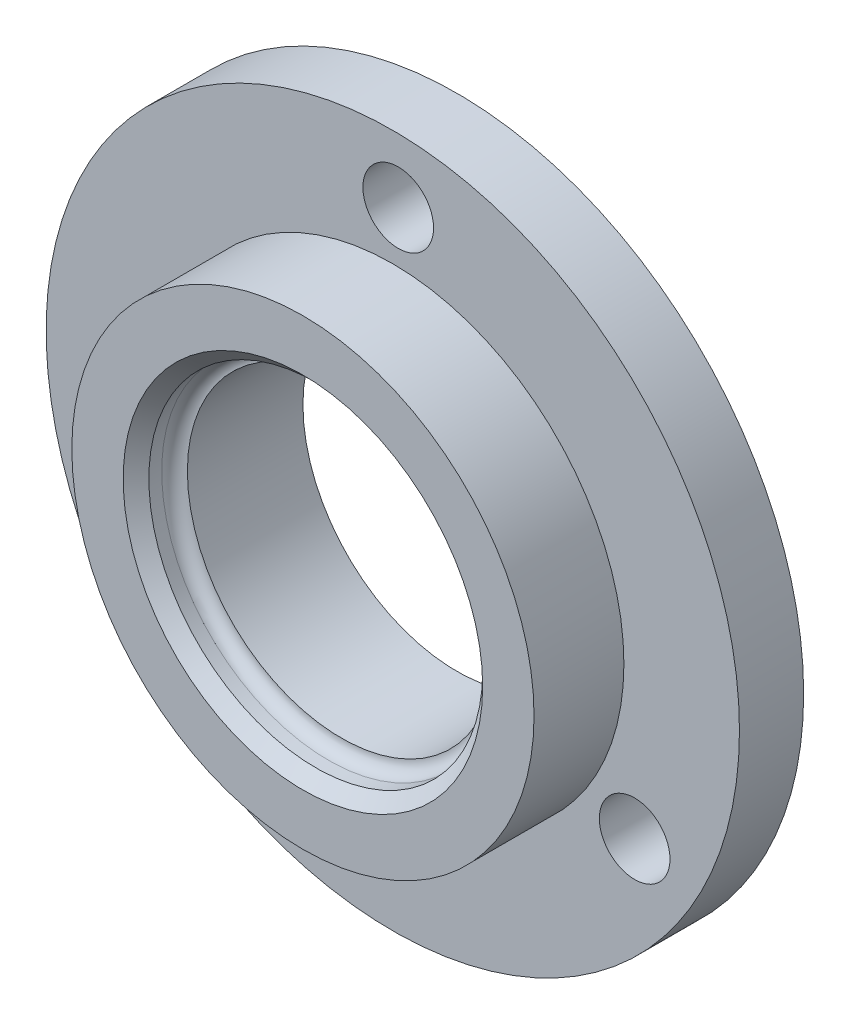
ISO-10303-21;
HEADER;
FILE_DESCRIPTION(('STEP AP214'),'2;1');
FILE_NAME('part.step','',(''),(''),'','','');
FILE_SCHEMA(('AUTOMOTIVE_DESIGN { 1 0 10303 214 1 1 1 1 }'));
ENDSEC;
DATA;
#1=APPLICATION_CONTEXT('core data for automotive mechanical design processes');
#2=APPLICATION_PROTOCOL_DEFINITION('international standard','automotive_design',2000,#1);
#3=PRODUCT_CONTEXT('',#1,'mechanical');
#4=PRODUCT('Part','Part','',(#3));
#5=PRODUCT_RELATED_PRODUCT_CATEGORY('part','',(#4));
#6=PRODUCT_DEFINITION_FORMATION('','',#4);
#7=PRODUCT_DEFINITION_CONTEXT('part definition',#1,'design');
#8=PRODUCT_DEFINITION('design','',#6,#7);
#9=PRODUCT_DEFINITION_SHAPE('','',#8);
#10=(LENGTH_UNIT() NAMED_UNIT(*) SI_UNIT(.MILLI.,.METRE.));
#11=(NAMED_UNIT(*) PLANE_ANGLE_UNIT() SI_UNIT($,.RADIAN.));
#12=(NAMED_UNIT(*) SI_UNIT($,.STERADIAN.) SOLID_ANGLE_UNIT());
#13=UNCERTAINTY_MEASURE_WITH_UNIT(LENGTH_MEASURE(1.E-05),#10,'distance_accuracy_value','');
#14=(GEOMETRIC_REPRESENTATION_CONTEXT(3) GLOBAL_UNCERTAINTY_ASSIGNED_CONTEXT((#13)) GLOBAL_UNIT_ASSIGNED_CONTEXT((#10,
#11,#12)) REPRESENTATION_CONTEXT('',''));
#15=CARTESIAN_POINT('',(0.,0.,0.));
#16=DIRECTION('',(0.,0.,1.));
#17=DIRECTION('',(1.,0.,0.));
#18=AXIS2_PLACEMENT_3D('',#15,#16,#17);
#19=CARTESIAN_POINT('',(0.,0.,0.));
#20=DIRECTION('',(0.,0.,1.));
#21=DIRECTION('',(1.,0.,0.));
#22=AXIS2_PLACEMENT_3D('',#19,#20,#21);
#23=PLANE('',#22);
#24=CARTESIAN_POINT('',(0.,0.,0.));
#25=DIRECTION('',(0.,0.,-1.));
#26=DIRECTION('',(-1.,0.,0.));
#27=AXIS2_PLACEMENT_3D('',#24,#25,#26);
#28=CIRCLE('',#27,12.);
#29=CARTESIAN_POINT('',(-12.,0.,0.));
#30=VERTEX_POINT('',#29);
#31=EDGE_CURVE('E79',#30,#30,#28,.T.);
#32=ORIENTED_EDGE('',*,*,#31,.F.);
#33=EDGE_LOOP('',(#32));
#34=FACE_BOUND('',#33,.T.);
#35=CARTESIAN_POINT('',(-19.260536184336,-10.6316389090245,0.));
#36=DIRECTION('',(0.,0.,-1.));
#37=DIRECTION('',(-1.,0.,0.));
#38=AXIS2_PLACEMENT_3D('',#35,#36,#37);
#39=CIRCLE('',#38,2.75);
#40=CARTESIAN_POINT('',(-22.010536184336,-10.6316389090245,0.));
#41=VERTEX_POINT('',#40);
#42=EDGE_CURVE('E73',#41,#41,#39,.T.);
#43=ORIENTED_EDGE('',*,*,#42,.F.);
#44=EDGE_LOOP('',(#43));
#45=FACE_BOUND('',#44,.T.);
#46=CARTESIAN_POINT('',(18.8375374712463,-11.3642941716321,0.));
#47=DIRECTION('',(0.,0.,-1.));
#48=DIRECTION('',(-1.,0.,0.));
#49=AXIS2_PLACEMENT_3D('',#46,#47,#48);
#50=CIRCLE('',#49,2.75);
#51=CARTESIAN_POINT('',(16.0875374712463,-11.3642941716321,0.));
#52=VERTEX_POINT('',#51);
#53=EDGE_CURVE('E67',#52,#52,#50,.T.);
#54=ORIENTED_EDGE('',*,*,#53,.F.);
#55=EDGE_LOOP('',(#54));
#56=FACE_BOUND('',#55,.T.);
#57=CARTESIAN_POINT('',(0.,0.,0.));
#58=DIRECTION('',(0.,0.,1.));
#59=DIRECTION('',(1.,0.,0.));
#60=AXIS2_PLACEMENT_3D('',#57,#58,#59);
#61=CIRCLE('',#60,27.);
#62=CARTESIAN_POINT('',(27.,0.,0.));
#63=VERTEX_POINT('',#62);
#64=EDGE_CURVE('E49',#63,#63,#61,.T.);
#65=ORIENTED_EDGE('',*,*,#64,.F.);
#66=EDGE_LOOP('',(#65));
#67=FACE_BOUND('',#66,.T.);
#68=CARTESIAN_POINT('',(0.422998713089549,21.9959330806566,0.));
#69=DIRECTION('',(0.,0.,-1.));
#70=DIRECTION('',(-1.,0.,0.));
#71=AXIS2_PLACEMENT_3D('',#68,#69,#70);
#72=CIRCLE('',#71,2.75);
#73=CARTESIAN_POINT('',(-2.32700128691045,21.9959330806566,0.));
#74=VERTEX_POINT('',#73);
#75=EDGE_CURVE('E61',#74,#74,#72,.T.);
#76=ORIENTED_EDGE('',*,*,#75,.F.);
#77=EDGE_LOOP('',(#76));
#78=FACE_BOUND('',#77,.T.);
#79=ADVANCED_FACE('F29',(#34,#45,#56,#67,#78),#23,.F.);
#80=CARTESIAN_POINT('',(0.,0.,5.));
#81=DIRECTION('',(0.,0.,1.));
#82=DIRECTION('',(1.,0.,0.));
#83=AXIS2_PLACEMENT_3D('',#80,#81,#82);
#84=PLANE('',#83);
#85=CARTESIAN_POINT('',(-19.260536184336,-10.6316389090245,5.));
#86=DIRECTION('',(0.,0.,1.));
#87=DIRECTION('',(1.,0.,0.));
#88=AXIS2_PLACEMENT_3D('',#85,#86,#87);
#89=CIRCLE('',#88,2.75);
#90=CARTESIAN_POINT('',(-16.510536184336,-10.6316389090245,5.));
#91=VERTEX_POINT('',#90);
#92=EDGE_CURVE('E70',#91,#91,#89,.T.);
#93=ORIENTED_EDGE('',*,*,#92,.F.);
#94=EDGE_LOOP('',(#93));
#95=FACE_BOUND('',#94,.T.);
#96=CARTESIAN_POINT('',(18.8375374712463,-11.3642941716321,5.));
#97=DIRECTION('',(0.,0.,1.));
#98=DIRECTION('',(1.,0.,0.));
#99=AXIS2_PLACEMENT_3D('',#96,#97,#98);
#100=CIRCLE('',#99,2.75);
#101=CARTESIAN_POINT('',(21.5875374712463,-11.3642941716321,5.));
#102=VERTEX_POINT('',#101);
#103=EDGE_CURVE('E64',#102,#102,#100,.T.);
#104=ORIENTED_EDGE('',*,*,#103,.F.);
#105=EDGE_LOOP('',(#104));
#106=FACE_BOUND('',#105,.T.);
#107=CARTESIAN_POINT('',(0.422998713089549,21.9959330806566,5.));
#108=DIRECTION('',(0.,0.,1.));
#109=DIRECTION('',(1.,0.,0.));
#110=AXIS2_PLACEMENT_3D('',#107,#108,#109);
#111=CIRCLE('',#110,2.75);
#112=CARTESIAN_POINT('',(3.17299871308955,21.9959330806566,5.));
#113=VERTEX_POINT('',#112);
#114=EDGE_CURVE('E58',#113,#113,#111,.T.);
#115=ORIENTED_EDGE('',*,*,#114,.F.);
#116=EDGE_LOOP('',(#115));
#117=FACE_BOUND('',#116,.T.);
#118=CARTESIAN_POINT('',(0.,0.,5.));
#119=DIRECTION('',(0.,0.,1.));
#120=DIRECTION('',(1.,0.,0.));
#121=AXIS2_PLACEMENT_3D('',#118,#119,#120);
#122=CIRCLE('',#121,27.);
#123=CARTESIAN_POINT('',(27.,0.,5.));
#124=VERTEX_POINT('',#123);
#125=EDGE_CURVE('E44',#124,#124,#122,.T.);
#126=ORIENTED_EDGE('',*,*,#125,.T.);
#127=EDGE_LOOP('',(#126));
#128=FACE_BOUND('',#127,.T.);
#129=CARTESIAN_POINT('',(0.,0.,5.));
#130=DIRECTION('',(0.,0.,1.));
#131=DIRECTION('',(1.,0.,0.));
#132=AXIS2_PLACEMENT_3D('',#129,#130,#131);
#133=CIRCLE('',#132,18.);
#134=CARTESIAN_POINT('',(18.,0.,5.));
#135=VERTEX_POINT('',#134);
#136=EDGE_CURVE('E55',#135,#135,#133,.T.);
#137=ORIENTED_EDGE('',*,*,#136,.F.);
#138=EDGE_LOOP('',(#137));
#139=FACE_BOUND('',#138,.T.);
#140=ADVANCED_FACE('F88',(#95,#106,#117,#128,#139),#84,.T.);
#141=CARTESIAN_POINT('',(0.,0.,5.));
#142=DIRECTION('',(0.,0.,-1.));
#143=DIRECTION('',(-1.,0.,0.));
#144=AXIS2_PLACEMENT_3D('',#141,#142,#143);
#145=CYLINDRICAL_SURFACE('',#144,27.);
#146=ORIENTED_EDGE('',*,*,#125,.F.);
#147=EDGE_LOOP('',(#146));
#148=FACE_BOUND('',#147,.T.);
#149=ORIENTED_EDGE('',*,*,#64,.T.);
#150=EDGE_LOOP('',(#149));
#151=FACE_BOUND('',#150,.T.);
#152=ADVANCED_FACE('F31',(#148,#151),#145,.T.);
#153=CARTESIAN_POINT('',(0.,0.,12.));
#154=DIRECTION('',(0.,0.,-1.));
#155=DIRECTION('',(-1.,0.,0.));
#156=AXIS2_PLACEMENT_3D('',#153,#154,#155);
#157=CYLINDRICAL_SURFACE('',#156,18.);
#158=CARTESIAN_POINT('',(0.,0.,12.));
#159=DIRECTION('',(0.,0.,1.));
#160=DIRECTION('',(1.,0.,0.));
#161=AXIS2_PLACEMENT_3D('',#158,#159,#160);
#162=CIRCLE('',#161,18.);
#163=CARTESIAN_POINT('',(18.,0.,12.));
#164=VERTEX_POINT('',#163);
#165=EDGE_CURVE('E52',#164,#164,#162,.T.);
#166=ORIENTED_EDGE('',*,*,#165,.F.);
#167=EDGE_LOOP('',(#166));
#168=FACE_BOUND('',#167,.T.);
#169=ORIENTED_EDGE('',*,*,#136,.T.);
#170=EDGE_LOOP('',(#169));
#171=FACE_BOUND('',#170,.T.);
#172=ADVANCED_FACE('F122',(#168,#171),#157,.T.);
#173=CARTESIAN_POINT('',(0.,0.,12.));
#174=DIRECTION('',(0.,0.,1.));
#175=DIRECTION('',(1.,0.,0.));
#176=AXIS2_PLACEMENT_3D('',#173,#174,#175);
#177=PLANE('',#176);
#178=CARTESIAN_POINT('',(0.,0.,12.));
#179=DIRECTION('',(0.,0.,1.));
#180=DIRECTION('',(1.,0.,0.));
#181=AXIS2_PLACEMENT_3D('',#178,#179,#180);
#182=CIRCLE('',#181,14.);
#183=CARTESIAN_POINT('',(14.,0.,12.));
#184=VERTEX_POINT('',#183);
#185=EDGE_CURVE('E10',#184,#184,#182,.F.);
#186=ORIENTED_EDGE('',*,*,#185,.T.);
#187=EDGE_LOOP('',(#186));
#188=FACE_BOUND('',#187,.T.);
#189=ORIENTED_EDGE('',*,*,#165,.T.);
#190=EDGE_LOOP('',(#189));
#191=FACE_BOUND('',#190,.T.);
#192=ADVANCED_FACE('F119',(#188,#191),#177,.T.);
#193=CARTESIAN_POINT('',(0.,0.,9.));
#194=DIRECTION('',(0.,0.,1.));
#195=DIRECTION('',(1.,0.,0.));
#196=AXIS2_PLACEMENT_3D('',#193,#194,#195);
#197=CYLINDRICAL_SURFACE('',#196,13.);
#198=CARTESIAN_POINT('',(0.,0.,11.));
#199=DIRECTION('',(0.,0.,1.));
#200=DIRECTION('',(1.,0.,0.));
#201=AXIS2_PLACEMENT_3D('',#198,#199,#200);
#202=CIRCLE('',#201,13.);
#203=CARTESIAN_POINT('',(13.,0.,11.));
#204=VERTEX_POINT('',#203);
#205=EDGE_CURVE('E36',#204,#204,#202,.T.);
#206=ORIENTED_EDGE('',*,*,#205,.T.);
#207=EDGE_LOOP('',(#206));
#208=FACE_BOUND('',#207,.T.);
#209=CARTESIAN_POINT('',(0.,0.,10.));
#210=DIRECTION('',(0.,0.,1.));
#211=DIRECTION('',(1.,0.,0.));
#212=AXIS2_PLACEMENT_3D('',#209,#210,#211);
#213=CIRCLE('',#212,13.);
#214=CARTESIAN_POINT('',(13.,0.,10.));
#215=VERTEX_POINT('',#214);
#216=EDGE_CURVE('E40',#215,#215,#213,.F.);
#217=ORIENTED_EDGE('',*,*,#216,.T.);
#218=EDGE_LOOP('',(#217));
#219=FACE_BOUND('',#218,.T.);
#220=ADVANCED_FACE('F112',(#208,#219),#197,.F.);
#221=CARTESIAN_POINT('',(0.,0.,10.));
#222=DIRECTION('',(0.,0.,1.));
#223=DIRECTION('',(1.,0.,0.));
#224=AXIS2_PLACEMENT_3D('',#221,#222,#223);
#225=TOROIDAL_SURFACE('',#224,12.,1.);
#226=ORIENTED_EDGE('',*,*,#216,.F.);
#227=EDGE_LOOP('',(#226));
#228=FACE_BOUND('',#227,.T.);
#229=CARTESIAN_POINT('',(0.,0.,9.));
#230=DIRECTION('',(0.,0.,1.));
#231=DIRECTION('',(1.,0.,0.));
#232=AXIS2_PLACEMENT_3D('',#229,#230,#231);
#233=CIRCLE('',#232,12.);
#234=CARTESIAN_POINT('',(12.,0.,9.));
#235=VERTEX_POINT('',#234);
#236=EDGE_CURVE('E76',#235,#235,#233,.F.);
#237=ORIENTED_EDGE('',*,*,#236,.T.);
#238=EDGE_LOOP('',(#237));
#239=FACE_BOUND('',#238,.T.);
#240=ADVANCED_FACE('F101',(#228,#239),#225,.F.);
#241=CARTESIAN_POINT('',(0.422998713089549,21.9959330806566,0.));
#242=DIRECTION('',(0.,0.,-1.));
#243=DIRECTION('',(-1.,0.,0.));
#244=AXIS2_PLACEMENT_3D('',#241,#242,#243);
#245=CYLINDRICAL_SURFACE('',#244,2.75);
#246=ORIENTED_EDGE('',*,*,#114,.T.);
#247=EDGE_LOOP('',(#246));
#248=FACE_BOUND('',#247,.T.);
#249=ORIENTED_EDGE('',*,*,#75,.T.);
#250=EDGE_LOOP('',(#249));
#251=FACE_BOUND('',#250,.T.);
#252=ADVANCED_FACE('F98',(#248,#251),#245,.F.);
#253=CARTESIAN_POINT('',(18.8375374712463,-11.3642941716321,0.));
#254=DIRECTION('',(0.,0.,-1.));
#255=DIRECTION('',(-1.,0.,0.));
#256=AXIS2_PLACEMENT_3D('',#253,#254,#255);
#257=CYLINDRICAL_SURFACE('',#256,2.75);
#258=ORIENTED_EDGE('',*,*,#103,.T.);
#259=EDGE_LOOP('',(#258));
#260=FACE_BOUND('',#259,.T.);
#261=ORIENTED_EDGE('',*,*,#53,.T.);
#262=EDGE_LOOP('',(#261));
#263=FACE_BOUND('',#262,.T.);
#264=ADVANCED_FACE('F100',(#260,#263),#257,.F.);
#265=CARTESIAN_POINT('',(-19.260536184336,-10.6316389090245,0.));
#266=DIRECTION('',(0.,0.,-1.));
#267=DIRECTION('',(-1.,0.,0.));
#268=AXIS2_PLACEMENT_3D('',#265,#266,#267);
#269=CYLINDRICAL_SURFACE('',#268,2.75);
#270=ORIENTED_EDGE('',*,*,#92,.T.);
#271=EDGE_LOOP('',(#270));
#272=FACE_BOUND('',#271,.T.);
#273=ORIENTED_EDGE('',*,*,#42,.T.);
#274=EDGE_LOOP('',(#273));
#275=FACE_BOUND('',#274,.T.);
#276=ADVANCED_FACE('F109',(#272,#275),#269,.F.);
#277=CARTESIAN_POINT('',(0.,0.,12.));
#278=DIRECTION('',(0.,0.,-1.));
#279=DIRECTION('',(-1.,0.,0.));
#280=AXIS2_PLACEMENT_3D('',#277,#278,#279);
#281=CYLINDRICAL_SURFACE('',#280,12.);
#282=ORIENTED_EDGE('',*,*,#31,.T.);
#283=EDGE_LOOP('',(#282));
#284=FACE_BOUND('',#283,.T.);
#285=ORIENTED_EDGE('',*,*,#236,.F.);
#286=EDGE_LOOP('',(#285));
#287=FACE_BOUND('',#286,.T.);
#288=ADVANCED_FACE('F83',(#284,#287),#281,.F.);
#289=CARTESIAN_POINT('',(0.,0.,11.));
#290=DIRECTION('',(0.,0.,1.));
#291=DIRECTION('',(1.,0.,0.));
#292=AXIS2_PLACEMENT_3D('',#289,#290,#291);
#293=CONICAL_SURFACE('',#292,13.,0.785398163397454);
#294=ORIENTED_EDGE('',*,*,#185,.F.);
#295=EDGE_LOOP('',(#294));
#296=FACE_BOUND('',#295,.T.);
#297=ORIENTED_EDGE('',*,*,#205,.F.);
#298=EDGE_LOOP('',(#297));
#299=FACE_BOUND('',#298,.T.);
#300=ADVANCED_FACE('F148',(#296,#299),#293,.F.);
#301=CLOSED_SHELL('',(#79,#140,#152,#172,#192,#220,#240,#252,#264,#276,#288,#300));
#302=MANIFOLD_SOLID_BREP('B2',#301);
#303=ADVANCED_BREP_SHAPE_REPRESENTATION('',(#18,#302),#14);
#304=SHAPE_DEFINITION_REPRESENTATION(#9,#303);
ENDSEC;
END-ISO-10303-21;
